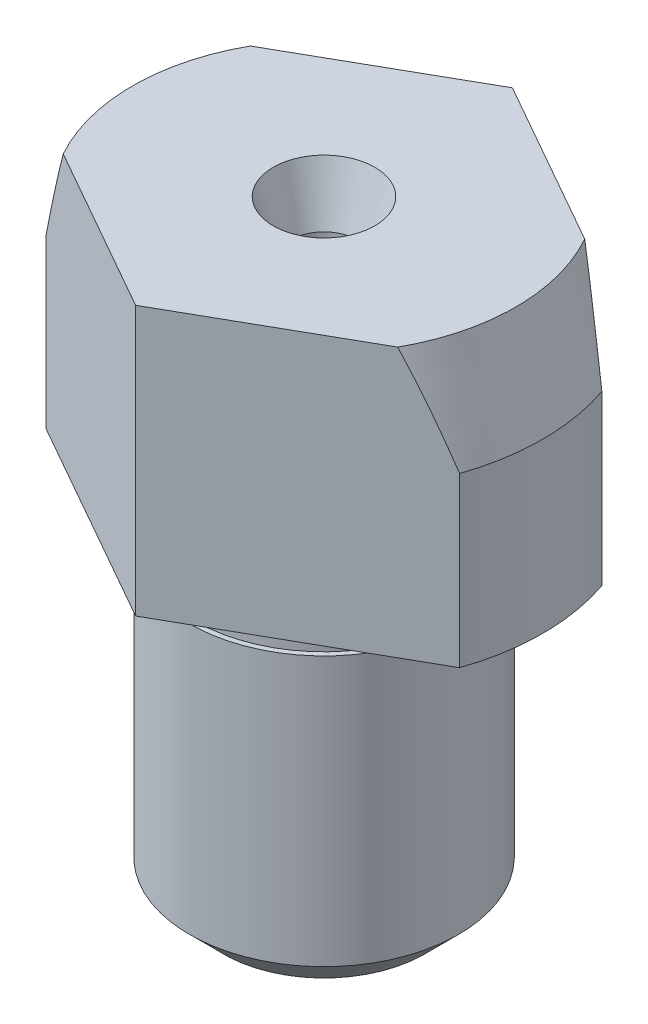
ISO-10303-21;
HEADER;
FILE_DESCRIPTION(('STEP AP214'),'2;1');
FILE_NAME('part.step','',(''),(''),'','','');
FILE_SCHEMA(('AUTOMOTIVE_DESIGN { 1 0 10303 214 1 1 1 1 }'));
ENDSEC;
DATA;
#1=APPLICATION_CONTEXT('core data for automotive mechanical design processes');
#2=APPLICATION_PROTOCOL_DEFINITION('international standard','automotive_design',2000,#1);
#3=PRODUCT_CONTEXT('',#1,'mechanical');
#4=PRODUCT('Part','Part','',(#3));
#5=PRODUCT_RELATED_PRODUCT_CATEGORY('part','',(#4));
#6=PRODUCT_DEFINITION_FORMATION('','',#4);
#7=PRODUCT_DEFINITION_CONTEXT('part definition',#1,'design');
#8=PRODUCT_DEFINITION('design','',#6,#7);
#9=PRODUCT_DEFINITION_SHAPE('','',#8);
#10=(LENGTH_UNIT() NAMED_UNIT(*) SI_UNIT(.MILLI.,.METRE.));
#11=(NAMED_UNIT(*) PLANE_ANGLE_UNIT() SI_UNIT($,.RADIAN.));
#12=(NAMED_UNIT(*) SI_UNIT($,.STERADIAN.) SOLID_ANGLE_UNIT());
#13=UNCERTAINTY_MEASURE_WITH_UNIT(LENGTH_MEASURE(1.E-05),#10,'distance_accuracy_value','');
#14=(GEOMETRIC_REPRESENTATION_CONTEXT(3) GLOBAL_UNCERTAINTY_ASSIGNED_CONTEXT((#13)) GLOBAL_UNIT_ASSIGNED_CONTEXT((#10,
#11,#12)) REPRESENTATION_CONTEXT('',''));
#15=CARTESIAN_POINT('',(0.,0.,0.));
#16=DIRECTION('',(0.,0.,1.));
#17=DIRECTION('',(1.,0.,0.));
#18=AXIS2_PLACEMENT_3D('',#15,#16,#17);
#19=CARTESIAN_POINT('',(0.,8.,-1.51));
#20=DIRECTION('',(0.,1.,0.));
#21=DIRECTION('',(0.,0.,1.));
#22=AXIS2_PLACEMENT_3D('',#19,#20,#21);
#23=PLANE('',#22);
#24=CARTESIAN_POINT('',(0.,8.,0.));
#25=DIRECTION('',(0.,-1.,0.));
#26=DIRECTION('',(0.,0.,-1.));
#27=AXIS2_PLACEMENT_3D('',#24,#25,#26);
#28=CIRCLE('',#27,1.51);
#29=CARTESIAN_POINT('',(0.,8.,-1.51));
#30=VERTEX_POINT('',#29);
#31=EDGE_CURVE('E203',#30,#30,#28,.T.);
#32=ORIENTED_EDGE('',*,*,#31,.T.);
#33=EDGE_LOOP('',(#32));
#34=FACE_BOUND('',#33,.T.);
#35=DIRECTION('',(-0.869833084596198,0.,-0.493346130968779));
#36=VECTOR('',#35,1.);
#37=CARTESIAN_POINT('',(9.87352482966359,8.,0.));
#38=LINE('',#37,#36);
#39=CARTESIAN_POINT('',(4.97154190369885,8.,-2.78027400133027));
#40=VERTEX_POINT('',#39);
#41=CARTESIAN_POINT('',(0.,8.,-5.6));
#42=VERTEX_POINT('',#41);
#43=EDGE_CURVE('E105',#40,#42,#38,.T.);
#44=ORIENTED_EDGE('',*,*,#43,.T.);
#45=DIRECTION('',(-0.869833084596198,0.,0.493346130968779));
#46=VECTOR('',#45,1.);
#47=CARTESIAN_POINT('',(0.,8.,-5.6));
#48=LINE('',#47,#46);
#49=CARTESIAN_POINT('',(-4.97154190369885,8.,-2.78027400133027));
#50=VERTEX_POINT('',#49);
#51=EDGE_CURVE('E111',#42,#50,#48,.T.);
#52=ORIENTED_EDGE('',*,*,#51,.T.);
#53=CARTESIAN_POINT('',(0.,8.,0.));
#54=DIRECTION('',(0.,-1.,0.));
#55=DIRECTION('',(0.,0.,-1.));
#56=AXIS2_PLACEMENT_3D('',#53,#54,#55);
#57=CIRCLE('',#56,5.69615242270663);
#58=CARTESIAN_POINT('',(-4.97154190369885,8.,2.78027400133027));
#59=VERTEX_POINT('',#58);
#60=EDGE_CURVE('E201',#59,#50,#57,.T.);
#61=ORIENTED_EDGE('',*,*,#60,.F.);
#62=DIRECTION('',(0.869833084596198,0.,0.493346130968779));
#63=VECTOR('',#62,1.);
#64=CARTESIAN_POINT('',(-9.87352482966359,8.,0.));
#65=LINE('',#64,#63);
#66=CARTESIAN_POINT('',(0.,8.,5.6));
#67=VERTEX_POINT('',#66);
#68=EDGE_CURVE('E125',#59,#67,#65,.T.);
#69=ORIENTED_EDGE('',*,*,#68,.T.);
#70=DIRECTION('',(0.869833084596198,0.,-0.493346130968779));
#71=VECTOR('',#70,1.);
#72=CARTESIAN_POINT('',(0.,8.,5.6));
#73=LINE('',#72,#71);
#74=CARTESIAN_POINT('',(4.97154190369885,8.,2.78027400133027));
#75=VERTEX_POINT('',#74);
#76=EDGE_CURVE('E123',#67,#75,#73,.T.);
#77=ORIENTED_EDGE('',*,*,#76,.T.);
#78=EDGE_CURVE('E122',#40,#75,#57,.T.);
#79=ORIENTED_EDGE('',*,*,#78,.F.);
#80=EDGE_LOOP('',(#44,#52,#61,#69,#77,#79));
#81=FACE_BOUND('',#80,.T.);
#82=ADVANCED_FACE('F32',(#34,#81),#23,.T.);
#83=CARTESIAN_POINT('',(0.,5.,0.));
#84=DIRECTION('',(0.,-1.,0.));
#85=DIRECTION('',(0.,0.,-1.));
#86=AXIS2_PLACEMENT_3D('',#83,#84,#85);
#87=CONICAL_SURFACE('',#86,6.5,0.26179938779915);
#88=CARTESIAN_POINT('',(0.,5.,0.));
#89=DIRECTION('',(0.,-1.,0.));
#90=DIRECTION('',(0.,0.,-1.));
#91=AXIS2_PLACEMENT_3D('',#88,#89,#90);
#92=CIRCLE('',#91,6.5);
#93=CARTESIAN_POINT('',(-6.14671173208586,5.,2.11374901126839));
#94=VERTEX_POINT('',#93);
#95=CARTESIAN_POINT('',(-6.14671173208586,5.,-2.11374901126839));
#96=VERTEX_POINT('',#95);
#97=EDGE_CURVE('E197',#94,#96,#92,.T.);
#98=ORIENTED_EDGE('',*,*,#97,.F.);
#99=CARTESIAN_POINT('',(-7.88064159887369,-0.453602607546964,1.1303102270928));
#100=CARTESIAN_POINT('',(-7.81543947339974,-0.232330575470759,1.16729113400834));
#101=CARTESIAN_POINT('',(-7.74984990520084,-0.0112095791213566,1.20449178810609));
#102=CARTESIAN_POINT('',(-7.6178014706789,0.430691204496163,1.27938613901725));
#103=CARTESIAN_POINT('',(-7.55134259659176,0.651470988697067,1.31707984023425));
#104=CARTESIAN_POINT('',(-7.35049361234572,1.3133279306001,1.43099602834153));
#105=CARTESIAN_POINT('',(-7.21465885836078,1.75382830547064,1.50803787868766));
#106=CARTESIAN_POINT('',(-6.93723870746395,2.63563888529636,1.66538319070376));
#107=CARTESIAN_POINT('',(-6.7956219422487,3.07693607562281,1.74570444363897));
#108=CARTESIAN_POINT('',(-6.50600923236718,3.95672114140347,1.90996504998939));
#109=CARTESIAN_POINT('',(-6.35801396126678,4.395209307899,1.99390402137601));
#110=CARTESIAN_POINT('',(-6.10140257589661,5.13056451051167,2.13944715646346));
#111=CARTESIAN_POINT('',(-5.99508438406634,5.42848939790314,2.19974799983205));
#112=CARTESIAN_POINT('',(-5.77729576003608,6.02189899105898,2.32327189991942));
#113=CARTESIAN_POINT('',(-5.6658246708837,6.31738337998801,2.38649532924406));
#114=CARTESIAN_POINT('',(-5.43649671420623,6.90418177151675,2.51656403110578));
#115=CARTESIAN_POINT('',(-5.31865659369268,7.19550438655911,2.58339980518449));
#116=CARTESIAN_POINT('',(-5.07408105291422,7.77314440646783,2.72211653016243));
#117=CARTESIAN_POINT('',(-4.94734823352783,8.05946324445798,2.79399600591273));
#118=CARTESIAN_POINT('',(-4.72369530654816,8.53401587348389,2.92084598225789));
#119=CARTESIAN_POINT('',(-4.63018399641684,8.7243652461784,2.97388310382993));
#120=CARTESIAN_POINT('',(-4.43515280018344,9.10021820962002,3.0844995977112));
#121=CARTESIAN_POINT('',(-4.33361611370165,9.28571049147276,3.14208849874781));
#122=CARTESIAN_POINT('',(-4.16929516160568,9.56439057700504,3.23528696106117));
#123=CARTESIAN_POINT('',(-4.11033442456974,9.6605521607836,3.26872791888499));
#124=CARTESIAN_POINT('',(-3.98864809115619,9.84965946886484,3.33774516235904));
#125=CARTESIAN_POINT('',(-3.92592355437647,9.94260608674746,3.37332084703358));
#126=CARTESIAN_POINT('',(-3.79603824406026,10.123911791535,3.44698833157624));
#127=CARTESIAN_POINT('',(-3.72889034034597,10.2122829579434,3.48507283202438));
#128=CARTESIAN_POINT('',(-3.58897587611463,10.3828779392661,3.56442858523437));
#129=CARTESIAN_POINT('',(-3.51621499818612,10.4651078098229,3.60569661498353));
#130=CARTESIAN_POINT('',(-3.37491478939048,10.6092068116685,3.68583832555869));
#131=CARTESIAN_POINT('',(-3.30732679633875,10.6722921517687,3.72417243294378));
#132=CARTESIAN_POINT('',(-3.16613498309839,10.7892397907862,3.80425266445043));
#133=CARTESIAN_POINT('',(-3.09252547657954,10.8430932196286,3.84600201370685));
#134=CARTESIAN_POINT('',(-2.93763282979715,10.9381755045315,3.93385299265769));
#135=CARTESIAN_POINT('',(-2.85624506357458,10.9791867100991,3.98001396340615));
#136=CARTESIAN_POINT('',(-2.68806363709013,11.041702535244,4.07540198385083));
#137=CARTESIAN_POINT('',(-2.60129302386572,11.0632849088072,4.12461596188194));
#138=CARTESIAN_POINT('',(-2.43743302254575,11.081603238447,4.21755298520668));
#139=CARTESIAN_POINT('',(-2.36059558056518,11.0812686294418,4.26113313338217));
#140=CARTESIAN_POINT('',(-2.20846413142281,11.0630269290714,4.34741803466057));
#141=CARTESIAN_POINT('',(-2.13317269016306,11.0450927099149,4.39012133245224));
#142=CARTESIAN_POINT('',(-1.97660283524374,10.9908765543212,4.4789235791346));
#143=CARTESIAN_POINT('',(-1.89591225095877,10.9524222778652,4.52468912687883));
#144=CARTESIAN_POINT('',(-1.74082069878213,10.861487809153,4.61265291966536));
#145=CARTESIAN_POINT('',(-1.66643120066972,10.8089827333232,4.65484465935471));
#146=CARTESIAN_POINT('',(-1.52959497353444,10.6989931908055,4.73245451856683));
#147=CARTESIAN_POINT('',(-1.46666929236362,10.6422774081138,4.76814428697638));
#148=CARTESIAN_POINT('',(-1.3452049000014,10.5228898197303,4.83703565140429));
#149=CARTESIAN_POINT('',(-1.28667035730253,10.4602124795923,4.87023488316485));
#150=CARTESIAN_POINT('',(-1.17320759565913,10.3303150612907,4.93458793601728));
#151=CARTESIAN_POINT('',(-1.11829177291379,10.2630808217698,4.96573472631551));
#152=CARTESIAN_POINT('',(-1.01171709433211,10.1253663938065,5.02618104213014));
#153=CARTESIAN_POINT('',(-0.960056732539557,10.0548877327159,5.05548142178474));
#154=CARTESIAN_POINT('',(-0.816819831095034,9.85062543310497,5.13672157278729));
#155=CARTESIAN_POINT('',(-0.72851906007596,9.71381180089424,5.18680341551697));
#156=CARTESIAN_POINT('',(-0.558838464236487,9.43458645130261,5.28304172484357));
#157=CARTESIAN_POINT('',(-0.477463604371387,9.29217082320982,5.32919537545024));
#158=CARTESIAN_POINT('',(-0.319940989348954,9.0031569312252,5.41853800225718));
#159=CARTESIAN_POINT('',(-0.243805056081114,8.85655020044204,5.46172027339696));
#160=CARTESIAN_POINT('',(-0.0958265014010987,8.56049606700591,5.54564976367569));
#161=CARTESIAN_POINT('',(-0.0239844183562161,8.41104831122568,5.58639667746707));
#162=CARTESIAN_POINT('',(0.116751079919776,8.10885511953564,5.66621809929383));
#163=CARTESIAN_POINT('',(0.185617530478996,7.95609315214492,5.70527731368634));
#164=CARTESIAN_POINT('',(0.320425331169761,7.64886836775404,5.78173670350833));
#165=CARTESIAN_POINT('',(0.386366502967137,7.49440544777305,5.81913677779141));
#166=CARTESIAN_POINT('',(0.580343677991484,7.02945904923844,5.929155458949));
#167=CARTESIAN_POINT('',(0.704738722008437,6.71696802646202,5.99970901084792));
#168=CARTESIAN_POINT('',(0.934778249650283,6.11870068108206,6.13018129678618));
#169=CARTESIAN_POINT('',(1.04107450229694,5.83325166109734,6.19046969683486));
#170=CARTESIAN_POINT('',(1.24911859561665,5.26015876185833,6.30846675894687));
#171=CARTESIAN_POINT('',(1.35086621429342,4.97251477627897,6.36617529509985));
#172=CARTESIAN_POINT('',(1.55078683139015,4.39534153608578,6.47956493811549));
#173=CARTESIAN_POINT('',(1.64895704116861,4.10581100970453,6.53524446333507));
#174=CARTESIAN_POINT('',(1.84230268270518,3.52543046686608,6.64490495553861));
#175=CARTESIAN_POINT('',(1.93747808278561,3.23458043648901,6.69888590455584));
#176=CARTESIAN_POINT('',(2.12220167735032,2.66153520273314,6.80365620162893));
#177=CARTESIAN_POINT('',(2.21183168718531,2.37937478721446,6.85449195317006));
#178=CARTESIAN_POINT('',(2.38911133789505,1.81423100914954,6.95504024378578));
#179=CARTESIAN_POINT('',(2.47676096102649,1.53124763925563,7.00475277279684));
#180=CARTESIAN_POINT('',(2.65025220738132,0.964949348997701,7.1031523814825));
#181=CARTESIAN_POINT('',(2.73609596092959,0.681635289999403,7.15184066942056));
#182=CARTESIAN_POINT('',(2.90630309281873,0.114427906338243,7.24837761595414));
#183=CARTESIAN_POINT('',(2.99066650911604,-0.169465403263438,7.29622629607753));
#184=CARTESIAN_POINT('',(3.07439918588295,-0.453602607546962,7.34371723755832));
#185=B_SPLINE_CURVE_WITH_KNOTS('',3,(#99,#100,#101,#102,#103,#104,#105,#106,#107,#108,#109,#110,
#111,#112,#113,#114,#115,#116,#117,#118,#119,#120,#121,#122,#123,#124,#125,#126,#127,#128,#129,
#130,#131,#132,#133,#134,#135,#136,#137,#138,#139,#140,#141,#142,#143,#144,#145,#146,#147,#148,
#149,#150,#151,#152,#153,#154,#155,#156,#157,#158,#159,#160,#161,#162,#163,#164,#165,#166,#167,
#168,#169,#170,#171,#172,#173,#174,#175,#176,#177,#178,#179,#180,#181,#182,#183,#184),
.UNSPECIFIED.,.F.,.F.,(4,2,2,2,2,2,2,2,2,2,2,2,2,2,2,2,2,2,2,2,2,2,2,2,2,2,2,2,2,2,2,2,2,2,2,2,
2,2,2,2,2,2,4),(0.,0.700871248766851,1.40174876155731,2.80380259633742,4.21487434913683,
5.62579745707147,6.59182106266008,7.55796816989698,8.52168796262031,9.48512705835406,
10.1408030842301,10.7978900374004,11.1507507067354,11.5035124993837,11.8552897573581,
12.2067154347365,12.5064894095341,12.8065498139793,13.1114502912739,13.4151250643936,
13.6783056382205,13.9418925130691,14.241498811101,14.5416392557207,14.8170066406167,
15.0926322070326,15.3691575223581,15.6455539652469,16.1561926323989,16.6671943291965,
17.1793136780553,17.6914971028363,18.2076243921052,18.7237831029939,19.7545772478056,
20.6860448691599,21.6175579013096,22.5497821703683,23.4820162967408,24.3831659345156,
25.2843236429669,26.1843507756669,27.0843547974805),.UNSPECIFIED.);
#186=EDGE_CURVE('E160',#94,#59,#185,.T.);
#187=ORIENTED_EDGE('',*,*,#186,.T.);
#188=ORIENTED_EDGE('',*,*,#60,.T.);
#189=CARTESIAN_POINT('',(3.07439918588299,-0.453602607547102,-7.34371723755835));
#190=CARTESIAN_POINT('',(3.00919706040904,-0.23233057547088,-7.3067363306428));
#191=CARTESIAN_POINT('',(2.94360749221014,-0.0112095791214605,-7.26953567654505));
#192=CARTESIAN_POINT('',(2.81155905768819,0.430691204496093,-7.19464132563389));
#193=CARTESIAN_POINT('',(2.74510018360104,0.651470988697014,-7.15694762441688));
#194=CARTESIAN_POINT('',(2.54425119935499,1.3133279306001,-7.0430314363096));
#195=CARTESIAN_POINT('',(2.40841644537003,1.75382830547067,-6.96598958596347));
#196=CARTESIAN_POINT('',(2.13099629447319,2.63563888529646,-6.80864427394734));
#197=CARTESIAN_POINT('',(1.98937952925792,3.07693607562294,-6.72832302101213));
#198=CARTESIAN_POINT('',(1.69976681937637,3.95672114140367,-6.5640624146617));
#199=CARTESIAN_POINT('',(1.55177154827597,4.39520930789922,-6.48012344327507));
#200=CARTESIAN_POINT('',(1.29516016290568,5.13056451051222,-6.33458030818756));
#201=CARTESIAN_POINT('',(1.18884197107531,5.42848939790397,-6.2742794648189));
#202=CARTESIAN_POINT('',(0.971053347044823,6.02189899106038,-6.15075556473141));
#203=CARTESIAN_POINT('',(0.859582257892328,6.31738337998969,-6.08753213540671));
#204=CARTESIAN_POINT('',(0.6302543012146,6.90418177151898,-5.95746343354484));
#205=CARTESIAN_POINT('',(0.512414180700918,7.19550438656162,-5.89062765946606));
#206=CARTESIAN_POINT('',(0.267838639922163,7.77314440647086,-5.75191093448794));
#207=CARTESIAN_POINT('',(0.141105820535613,8.05946324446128,-5.68003145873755));
#208=CARTESIAN_POINT('',(-0.0825471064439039,8.5340158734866,-5.55318148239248));
#209=CARTESIAN_POINT('',(-0.176058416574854,8.72436524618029,-5.50014436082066));
#210=CARTESIAN_POINT('',(-0.371089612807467,9.10021820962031,-5.38952786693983));
#211=CARTESIAN_POINT('',(-0.472626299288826,9.28571049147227,-5.33193896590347));
#212=CARTESIAN_POINT('',(-0.636947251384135,9.56439057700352,-5.23874050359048));
#213=CARTESIAN_POINT('',(-0.695907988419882,9.6605521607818,-5.20529954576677));
#214=CARTESIAN_POINT('',(-0.817594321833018,9.84965946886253,-5.13628230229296));
#215=CARTESIAN_POINT('',(-0.880318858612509,9.9426060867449,-5.10070661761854));
#216=CARTESIAN_POINT('',(-1.01020416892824,10.123911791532,-5.02703913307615));
#217=CARTESIAN_POINT('',(-1.07735207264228,10.2122829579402,-4.98895463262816));
#218=CARTESIAN_POINT('',(-1.21726653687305,10.3828779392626,-4.90959887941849));
#219=CARTESIAN_POINT('',(-1.29002741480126,10.4651078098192,-4.8683308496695));
#220=CARTESIAN_POINT('',(-1.43132762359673,10.6092068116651,-4.78818913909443));
#221=CARTESIAN_POINT('',(-1.49891561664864,10.6722921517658,-4.74985503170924));
#222=CARTESIAN_POINT('',(-1.64010742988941,10.789239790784,-4.66977480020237));
#223=CARTESIAN_POINT('',(-1.71371693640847,10.8430932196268,-4.62802545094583));
#224=CARTESIAN_POINT('',(-1.86860958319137,10.9381755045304,-4.5401744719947));
#225=CARTESIAN_POINT('',(-1.94999734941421,10.9791867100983,-4.49401350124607));
#226=CARTESIAN_POINT('',(-2.11817877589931,11.0417025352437,-4.39862548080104));
#227=CARTESIAN_POINT('',(-2.20494938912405,11.063284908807,-4.34941150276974));
#228=CARTESIAN_POINT('',(-2.36880939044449,11.081603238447,-4.25647447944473));
#229=CARTESIAN_POINT('',(-2.44564683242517,11.0812686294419,-4.21289433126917));
#230=CARTESIAN_POINT('',(-2.59777828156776,11.0630269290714,-4.12660942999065));
#231=CARTESIAN_POINT('',(-2.67306972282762,11.045092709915,-4.08390613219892));
#232=CARTESIAN_POINT('',(-2.82963957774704,10.9908765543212,-3.9951038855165));
#233=CARTESIAN_POINT('',(-2.91033016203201,10.9524222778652,-3.94933833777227));
#234=CARTESIAN_POINT('',(-3.06542171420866,10.861487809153,-3.86137454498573));
#235=CARTESIAN_POINT('',(-3.13981121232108,10.8089827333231,-3.81918280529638));
#236=CARTESIAN_POINT('',(-3.27664743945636,10.6989931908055,-3.74157294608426));
#237=CARTESIAN_POINT('',(-3.33957312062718,10.6422774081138,-3.70588317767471));
#238=CARTESIAN_POINT('',(-3.46103751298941,10.5228898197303,-3.63699181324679));
#239=CARTESIAN_POINT('',(-3.51957205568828,10.4602124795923,-3.60379258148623));
#240=CARTESIAN_POINT('',(-3.63303481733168,10.3303150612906,-3.53943952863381));
#241=CARTESIAN_POINT('',(-3.68795064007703,10.2630808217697,-3.50829273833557));
#242=CARTESIAN_POINT('',(-3.79452531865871,10.1253663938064,-3.44784642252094));
#243=CARTESIAN_POINT('',(-3.84618568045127,10.0548877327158,-3.41854604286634));
#244=CARTESIAN_POINT('',(-3.9894225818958,9.85062543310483,-3.33730589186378));
#245=CARTESIAN_POINT('',(-4.07772335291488,9.71381180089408,-3.28722404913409));
#246=CARTESIAN_POINT('',(-4.24740394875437,9.4345864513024,-3.19098573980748));
#247=CARTESIAN_POINT('',(-4.32877880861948,9.2921708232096,-3.14483208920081));
#248=CARTESIAN_POINT('',(-4.48630142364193,9.00315693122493,-3.05548946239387));
#249=CARTESIAN_POINT('',(-4.56243735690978,8.85655020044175,-3.01230719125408));
#250=CARTESIAN_POINT('',(-4.71041591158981,8.56049606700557,-2.92837770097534));
#251=CARTESIAN_POINT('',(-4.7822579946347,8.41104831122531,-2.88763078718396));
#252=CARTESIAN_POINT('',(-4.9229934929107,8.10885511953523,-2.80780936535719));
#253=CARTESIAN_POINT('',(-4.99185994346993,7.95609315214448,-2.76875015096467));
#254=CARTESIAN_POINT('',(-5.12666774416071,7.64886836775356,-2.69229076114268));
#255=CARTESIAN_POINT('',(-5.19260891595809,7.49440544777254,-2.65489068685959));
#256=CARTESIAN_POINT('',(-5.38658609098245,7.02945904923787,-2.54487200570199));
#257=CARTESIAN_POINT('',(-5.51098113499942,6.7169680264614,-2.47431845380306));
#258=CARTESIAN_POINT('',(-5.74102066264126,6.11870068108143,-2.34384616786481));
#259=CARTESIAN_POINT('',(-5.84731691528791,5.83325166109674,-2.28355776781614));
#260=CARTESIAN_POINT('',(-6.05536100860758,5.26015876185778,-2.16556070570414));
#261=CARTESIAN_POINT('',(-6.15710862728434,4.97251477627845,-2.10785216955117));
#262=CARTESIAN_POINT('',(-6.35702924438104,4.39534153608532,-1.99446252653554));
#263=CARTESIAN_POINT('',(-6.45519945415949,4.1058110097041,-1.93878300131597));
#264=CARTESIAN_POINT('',(-6.64854509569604,3.52543046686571,-1.82912250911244));
#265=CARTESIAN_POINT('',(-6.74372049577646,3.23458043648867,-1.77514156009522));
#266=CARTESIAN_POINT('',(-6.92844409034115,2.66153520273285,-1.67037126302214));
#267=CARTESIAN_POINT('',(-7.01807410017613,2.3793747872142,-1.61953551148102));
#268=CARTESIAN_POINT('',(-7.19535375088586,1.81423100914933,-1.51898722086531));
#269=CARTESIAN_POINT('',(-7.28300337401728,1.53124763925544,-1.46927469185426));
#270=CARTESIAN_POINT('',(-7.4564946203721,0.964949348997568,-1.37087508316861));
#271=CARTESIAN_POINT('',(-7.54233837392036,0.681635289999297,-1.32218679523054));
#272=CARTESIAN_POINT('',(-7.71254550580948,0.114427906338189,-1.22564984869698));
#273=CARTESIAN_POINT('',(-7.79690892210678,-0.169465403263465,-1.17780116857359));
#274=CARTESIAN_POINT('',(-7.88064159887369,-0.453602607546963,-1.1303102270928));
#275=B_SPLINE_CURVE_WITH_KNOTS('',3,(#189,#190,#191,#192,#193,#194,#195,#196,#197,#198,#199,
#200,#201,#202,#203,#204,#205,#206,#207,#208,#209,#210,#211,#212,#213,#214,#215,#216,#217,#218,
#219,#220,#221,#222,#223,#224,#225,#226,#227,#228,#229,#230,#231,#232,#233,#234,#235,#236,#237,
#238,#239,#240,#241,#242,#243,#244,#245,#246,#247,#248,#249,#250,#251,#252,#253,#254,#255,#256,
#257,#258,#259,#260,#261,#262,#263,#264,#265,#266,#267,#268,#269,#270,#271,#272,#273,#274),
.UNSPECIFIED.,.F.,.F.,(4,2,2,2,2,2,2,2,2,2,2,2,2,2,2,2,2,2,2,2,2,2,2,2,2,2,2,2,2,2,2,2,2,2,2,2,
2,2,2,2,2,2,4),(0.,0.700871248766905,1.40174876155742,2.80380259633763,4.21487434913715,
5.6257974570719,6.59182106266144,7.55796816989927,8.52168796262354,9.48512705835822,
10.1408030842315,10.7978900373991,11.1507507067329,11.5035124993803,11.8552897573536,
12.2067154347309,12.5064894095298,12.8065498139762,13.1114502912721,13.415125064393,
13.6783056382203,13.9418925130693,14.2414988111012,14.541639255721,14.8170066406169,
15.0926322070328,15.3691575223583,15.6455539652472,16.1561926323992,16.6671943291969,
17.1793136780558,17.6914971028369,18.2076243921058,18.7237831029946,19.7545772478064,
20.6860448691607,21.6175579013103,22.5497821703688,23.4820162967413,24.383165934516,
25.2843236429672,26.1843507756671,27.0843547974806),.UNSPECIFIED.);
#276=EDGE_CURVE('E114',#50,#96,#275,.T.);
#277=ORIENTED_EDGE('',*,*,#276,.T.);
#278=EDGE_LOOP('',(#98,#187,#188,#277));
#279=FACE_BOUND('',#278,.T.);
#280=ADVANCED_FACE('F141',(#279),#87,.T.);
#281=CARTESIAN_POINT('',(6.14671173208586,5.,-2.11374901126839));
#282=VERTEX_POINT('',#281);
#283=CARTESIAN_POINT('',(6.14671173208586,5.,2.11374901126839));
#284=VERTEX_POINT('',#283);
#285=EDGE_CURVE('E198',#282,#284,#92,.T.);
#286=ORIENTED_EDGE('',*,*,#285,.F.);
#287=CARTESIAN_POINT('',(7.88064159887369,-0.45360260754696,-1.1303102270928));
#288=CARTESIAN_POINT('',(7.81543947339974,-0.232330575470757,-1.16729113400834));
#289=CARTESIAN_POINT('',(7.74984990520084,-0.0112095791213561,-1.20449178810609));
#290=CARTESIAN_POINT('',(7.6178014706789,0.430691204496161,-1.27938613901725));
#291=CARTESIAN_POINT('',(7.55134259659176,0.651470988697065,-1.31707984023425));
#292=CARTESIAN_POINT('',(7.35049361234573,1.31332793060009,-1.43099602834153));
#293=CARTESIAN_POINT('',(7.21465885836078,1.75382830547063,-1.50803787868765));
#294=CARTESIAN_POINT('',(6.93723870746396,2.63563888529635,-1.66538319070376));
#295=CARTESIAN_POINT('',(6.7956219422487,3.07693607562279,-1.74570444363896));
#296=CARTESIAN_POINT('',(6.50600923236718,3.95672114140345,-1.90996504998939));
#297=CARTESIAN_POINT('',(6.35801396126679,4.39520930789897,-1.99390402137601));
#298=CARTESIAN_POINT('',(6.10140257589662,5.13056451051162,-2.13944715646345));
#299=CARTESIAN_POINT('',(5.99508438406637,5.42848939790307,-2.19974799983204));
#300=CARTESIAN_POINT('',(5.77729576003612,6.02189899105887,-2.32327189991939));
#301=CARTESIAN_POINT('',(5.66582467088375,6.31738337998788,-2.38649532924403));
#302=CARTESIAN_POINT('',(5.4364967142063,6.90418177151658,-2.51656403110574));
#303=CARTESIAN_POINT('',(5.31865659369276,7.19550438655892,-2.58339980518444));
#304=CARTESIAN_POINT('',(5.07408105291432,7.77314440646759,-2.72211653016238));
#305=CARTESIAN_POINT('',(4.94734823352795,8.05946324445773,-2.79399600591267));
#306=CARTESIAN_POINT('',(4.72369530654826,8.53401587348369,-2.92084598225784));
#307=CARTESIAN_POINT('',(4.63018399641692,8.72436524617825,-2.97388310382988));
#308=CARTESIAN_POINT('',(4.43515280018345,9.10021820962,-3.08449959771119));
#309=CARTESIAN_POINT('',(4.33361611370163,9.2857104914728,-3.14208849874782));
#310=CARTESIAN_POINT('',(4.16929516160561,9.56439057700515,-3.23528696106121));
#311=CARTESIAN_POINT('',(4.11033442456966,9.66055216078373,-3.26872791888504));
#312=CARTESIAN_POINT('',(3.98864809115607,9.84965946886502,-3.3377451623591));
#313=CARTESIAN_POINT('',(3.92592355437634,9.94260608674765,-3.37332084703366));
#314=CARTESIAN_POINT('',(3.79603824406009,10.1239117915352,-3.44698833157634));
#315=CARTESIAN_POINT('',(3.72889034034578,10.2122829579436,-3.48507283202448));
#316=CARTESIAN_POINT('',(3.58897587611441,10.3828779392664,-3.5644285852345));
#317=CARTESIAN_POINT('',(3.51621499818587,10.4651078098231,-3.60569661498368));
#318=CARTESIAN_POINT('',(3.37491478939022,10.6092068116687,-3.68583832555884));
#319=CARTESIAN_POINT('',(3.3073267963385,10.672292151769,-3.72417243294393));
#320=CARTESIAN_POINT('',(3.16613498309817,10.7892397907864,-3.80425266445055));
#321=CARTESIAN_POINT('',(3.09252547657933,10.8430932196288,-3.84600201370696));
#322=CARTESIAN_POINT('',(2.93763282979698,10.9381755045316,-3.93385299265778));
#323=CARTESIAN_POINT('',(2.85624506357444,10.9791867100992,-3.98001396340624));
#324=CARTESIAN_POINT('',(2.68806363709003,11.041702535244,-4.07540198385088));
#325=CARTESIAN_POINT('',(2.60129302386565,11.0632849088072,-4.12461596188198));
#326=CARTESIAN_POINT('',(2.43743302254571,11.081603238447,-4.2175529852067));
#327=CARTESIAN_POINT('',(2.36059558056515,11.0812686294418,-4.26113313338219));
#328=CARTESIAN_POINT('',(2.2084641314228,11.0630269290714,-4.34741803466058));
#329=CARTESIAN_POINT('',(2.13317269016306,11.0450927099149,-4.39012133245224));
#330=CARTESIAN_POINT('',(1.97660283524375,10.9908765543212,-4.4789235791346));
#331=CARTESIAN_POINT('',(1.89591225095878,10.9524222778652,-4.52468912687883));
#332=CARTESIAN_POINT('',(1.74082069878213,10.861487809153,-4.61265291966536));
#333=CARTESIAN_POINT('',(1.66643120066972,10.8089827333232,-4.65484465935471));
#334=CARTESIAN_POINT('',(1.52959497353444,10.6989931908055,-4.73245451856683));
#335=CARTESIAN_POINT('',(1.46666929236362,10.6422774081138,-4.76814428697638));
#336=CARTESIAN_POINT('',(1.34520490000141,10.5228898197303,-4.83703565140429));
#337=CARTESIAN_POINT('',(1.28667035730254,10.4602124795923,-4.87023488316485));
#338=CARTESIAN_POINT('',(1.17320759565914,10.3303150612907,-4.93458793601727));
#339=CARTESIAN_POINT('',(1.11829177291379,10.2630808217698,-4.96573472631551));
#340=CARTESIAN_POINT('',(1.01171709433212,10.1253663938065,-5.02618104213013));
#341=CARTESIAN_POINT('',(0.960056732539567,10.0548877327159,-5.05548142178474));
#342=CARTESIAN_POINT('',(0.816819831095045,9.85062543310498,-5.13672157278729));
#343=CARTESIAN_POINT('',(0.728519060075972,9.71381180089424,-5.18680341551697));
#344=CARTESIAN_POINT('',(0.5588384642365,9.43458645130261,-5.28304172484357));
#345=CARTESIAN_POINT('',(0.4774636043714,9.29217082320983,-5.32919537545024));
#346=CARTESIAN_POINT('',(0.319940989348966,9.00315693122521,-5.41853800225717));
#347=CARTESIAN_POINT('',(0.243805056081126,8.85655020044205,-5.46172027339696));
#348=CARTESIAN_POINT('',(0.0958265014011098,8.56049606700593,-5.54564976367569));
#349=CARTESIAN_POINT('',(0.0239844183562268,8.41104831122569,-5.58639667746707));
#350=CARTESIAN_POINT('',(-0.116751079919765,8.10885511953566,-5.66621809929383));
#351=CARTESIAN_POINT('',(-0.185617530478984,7.95609315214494,-5.70527731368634));
#352=CARTESIAN_POINT('',(-0.320425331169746,7.64886836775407,-5.78173670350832));
#353=CARTESIAN_POINT('',(-0.386366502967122,7.49440544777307,-5.81913677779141));
#354=CARTESIAN_POINT('',(-0.580343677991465,7.02945904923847,-5.929155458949));
#355=CARTESIAN_POINT('',(-0.704738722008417,6.71696802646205,-5.99970901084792));
#356=CARTESIAN_POINT('',(-0.934778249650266,6.11870068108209,-6.13018129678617));
#357=CARTESIAN_POINT('',(-1.04107450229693,5.83325166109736,-6.19046969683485));
#358=CARTESIAN_POINT('',(-1.24911859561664,5.26015876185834,-6.30846675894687));
#359=CARTESIAN_POINT('',(-1.35086621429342,4.97251477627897,-6.36617529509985));
#360=CARTESIAN_POINT('',(-1.55078683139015,4.39534153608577,-6.4795649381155));
#361=CARTESIAN_POINT('',(-1.64895704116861,4.10581100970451,-6.53524446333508));
#362=CARTESIAN_POINT('',(-1.84230268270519,3.52543046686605,-6.64490495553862));
#363=CARTESIAN_POINT('',(-1.93747808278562,3.23458043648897,-6.69888590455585));
#364=CARTESIAN_POINT('',(-2.12220167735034,2.66153520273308,-6.80365620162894));
#365=CARTESIAN_POINT('',(-2.21183168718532,2.3793747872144,-6.85449195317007));
#366=CARTESIAN_POINT('',(-2.38911133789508,1.81423100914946,-6.9550402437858));
#367=CARTESIAN_POINT('',(-2.47676096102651,1.53124763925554,-7.00475277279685));
#368=CARTESIAN_POINT('',(-2.65025220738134,0.964949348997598,-7.10315238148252));
#369=CARTESIAN_POINT('',(-2.73609596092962,0.681635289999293,-7.15184066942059));
#370=CARTESIAN_POINT('',(-2.90630309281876,0.114427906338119,-7.24837761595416));
#371=CARTESIAN_POINT('',(-2.99066650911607,-0.169465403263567,-7.29622629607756));
#372=CARTESIAN_POINT('',(-3.07439918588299,-0.453602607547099,-7.34371723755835));
#373=B_SPLINE_CURVE_WITH_KNOTS('',3,(#287,#288,#289,#290,#291,#292,#293,#294,#295,#296,#297,
#298,#299,#300,#301,#302,#303,#304,#305,#306,#307,#308,#309,#310,#311,#312,#313,#314,#315,#316,
#317,#318,#319,#320,#321,#322,#323,#324,#325,#326,#327,#328,#329,#330,#331,#332,#333,#334,#335,
#336,#337,#338,#339,#340,#341,#342,#343,#344,#345,#346,#347,#348,#349,#350,#351,#352,#353,#354,
#355,#356,#357,#358,#359,#360,#361,#362,#363,#364,#365,#366,#367,#368,#369,#370,#371,#372),
.UNSPECIFIED.,.F.,.F.,(4,2,2,2,2,2,2,2,2,2,2,2,2,2,2,2,2,2,2,2,2,2,2,2,2,2,2,2,2,2,2,2,2,2,2,2,
2,2,2,2,2,2,4),(0.,0.700871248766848,1.4017487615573,2.8038025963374,4.2148743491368,
5.62579745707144,6.59182106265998,7.55796816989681,8.52168796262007,9.48512705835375,
10.14080308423,10.7978900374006,11.1507507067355,11.503512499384,11.8552897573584,
12.2067154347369,12.5064894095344,12.8065498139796,13.1114502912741,13.4151250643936,
13.6783056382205,13.9418925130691,14.241498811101,14.5416392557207,14.8170066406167,
15.0926322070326,15.369157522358,15.6455539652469,16.1561926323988,16.6671943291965,
17.1793136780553,17.6914971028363,18.2076243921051,18.7237831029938,19.7545772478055,
20.6860448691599,21.6175579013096,22.5497821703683,23.4820162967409,24.3831659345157,
25.284323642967,26.184350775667,27.0843547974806),.UNSPECIFIED.);
#374=EDGE_CURVE('E226',#282,#40,#373,.T.);
#375=ORIENTED_EDGE('',*,*,#374,.T.);
#376=ORIENTED_EDGE('',*,*,#78,.T.);
#377=CARTESIAN_POINT('',(-3.07439918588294,-0.45360260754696,7.34371723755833));
#378=CARTESIAN_POINT('',(-3.009197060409,-0.232330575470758,7.30673633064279));
#379=CARTESIAN_POINT('',(-2.9436074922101,-0.0112095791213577,7.26953567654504));
#380=CARTESIAN_POINT('',(-2.81155905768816,0.430691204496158,7.19464132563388));
#381=CARTESIAN_POINT('',(-2.74510018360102,0.65147098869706,7.15694762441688));
#382=CARTESIAN_POINT('',(-2.54425119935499,1.31332793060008,7.0430314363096));
#383=CARTESIAN_POINT('',(-2.40841644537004,1.75382830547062,6.96598958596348));
#384=CARTESIAN_POINT('',(-2.13099629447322,2.63563888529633,6.80864427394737));
#385=CARTESIAN_POINT('',(-1.98937952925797,3.07693607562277,6.72832302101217));
#386=CARTESIAN_POINT('',(-1.69976681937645,3.95672114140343,6.56406241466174));
#387=CARTESIAN_POINT('',(-1.55177154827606,4.39520930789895,6.48012344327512));
#388=CARTESIAN_POINT('',(-1.2951601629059,5.13056451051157,6.33458030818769));
#389=CARTESIAN_POINT('',(-1.18884197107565,5.428489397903,6.2742794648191));
#390=CARTESIAN_POINT('',(-0.971053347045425,6.02189899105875,6.15075556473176));
#391=CARTESIAN_POINT('',(-0.859582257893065,6.31738337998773,6.08753213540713));
#392=CARTESIAN_POINT('',(-0.630254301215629,6.90418177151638,5.95746343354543));
#393=CARTESIAN_POINT('',(-0.512414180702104,7.1955043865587,5.89062765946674));
#394=CARTESIAN_POINT('',(-0.267838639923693,7.77314440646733,5.75191093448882));
#395=CARTESIAN_POINT('',(-0.141105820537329,8.05946324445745,5.68003145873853));
#396=CARTESIAN_POINT('',(0.0825471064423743,8.53401587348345,5.55318148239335));
#397=CARTESIAN_POINT('',(0.176058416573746,8.72436524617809,5.50014436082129));
#398=CARTESIAN_POINT('',(0.371089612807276,9.10021820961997,5.38952786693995));
#399=CARTESIAN_POINT('',(0.472626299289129,9.28571049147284,5.3319389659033));
#400=CARTESIAN_POINT('',(0.636947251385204,9.56439057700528,5.23874050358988));
#401=CARTESIAN_POINT('',(0.695907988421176,9.66055216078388,5.20529954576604));
#402=CARTESIAN_POINT('',(0.817594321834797,9.8496594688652,5.13628230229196));
#403=CARTESIAN_POINT('',(0.880318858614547,9.94260608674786,5.10070661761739));
#404=CARTESIAN_POINT('',(1.01020416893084,10.1239117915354,5.02703913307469));
#405=CARTESIAN_POINT('',(1.07735207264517,10.2122829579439,4.98895463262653));
#406=CARTESIAN_POINT('',(1.21726653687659,10.3828779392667,4.90959887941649));
#407=CARTESIAN_POINT('',(1.29002741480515,10.4651078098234,4.8683308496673));
#408=CARTESIAN_POINT('',(1.43132762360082,10.609206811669,4.78818913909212));
#409=CARTESIAN_POINT('',(1.49891561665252,10.6722921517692,4.74985503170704));
#410=CARTESIAN_POINT('',(1.64010742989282,10.7892397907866,4.66977480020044));
#411=CARTESIAN_POINT('',(1.71371693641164,10.8430932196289,4.62802545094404));
#412=CARTESIAN_POINT('',(1.86860958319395,10.9381755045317,4.54017447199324));
#413=CARTESIAN_POINT('',(1.94999734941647,10.9791867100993,4.4940135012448));
#414=CARTESIAN_POINT('',(2.11817877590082,11.041702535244,4.39862548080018));
#415=CARTESIAN_POINT('',(2.20494938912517,11.0632849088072,4.3494115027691));
#416=CARTESIAN_POINT('',(2.36880939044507,11.081603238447,4.2564744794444));
#417=CARTESIAN_POINT('',(2.44564683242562,11.0812686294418,4.21289433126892));
#418=CARTESIAN_POINT('',(2.59777828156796,11.0630269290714,4.12660942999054));
#419=CARTESIAN_POINT('',(2.67306972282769,11.0450927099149,4.08390613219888));
#420=CARTESIAN_POINT('',(2.82963957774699,10.9908765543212,3.99510388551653));
#421=CARTESIAN_POINT('',(2.91033016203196,10.9524222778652,3.9493383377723));
#422=CARTESIAN_POINT('',(3.06542171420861,10.861487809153,3.86137454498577));
#423=CARTESIAN_POINT('',(3.13981121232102,10.8089827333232,3.81918280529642));
#424=CARTESIAN_POINT('',(3.2766474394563,10.6989931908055,3.7415729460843));
#425=CARTESIAN_POINT('',(3.33957312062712,10.6422774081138,3.70588317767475));
#426=CARTESIAN_POINT('',(3.46103751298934,10.5228898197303,3.63699181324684));
#427=CARTESIAN_POINT('',(3.5195720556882,10.4602124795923,3.60379258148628));
#428=CARTESIAN_POINT('',(3.6330348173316,10.3303150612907,3.53943952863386));
#429=CARTESIAN_POINT('',(3.68795064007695,10.2630808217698,3.50829273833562));
#430=CARTESIAN_POINT('',(3.79452531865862,10.1253663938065,3.447846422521));
#431=CARTESIAN_POINT('',(3.84618568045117,10.0548877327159,3.4185460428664));
#432=CARTESIAN_POINT('',(3.98942258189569,9.85062543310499,3.33730589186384));
#433=CARTESIAN_POINT('',(4.07772335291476,9.71381180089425,3.28722404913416));
#434=CARTESIAN_POINT('',(4.24740394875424,9.43458645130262,3.19098573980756));
#435=CARTESIAN_POINT('',(4.32877880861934,9.29217082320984,3.14483208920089));
#436=CARTESIAN_POINT('',(4.48630142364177,9.00315693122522,3.05548946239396));
#437=CARTESIAN_POINT('',(4.56243735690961,8.85655020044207,3.01230719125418));
#438=CARTESIAN_POINT('',(4.71041591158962,8.56049606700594,2.92837770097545));
#439=CARTESIAN_POINT('',(4.78225799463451,8.41104831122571,2.88763078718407));
#440=CARTESIAN_POINT('',(4.9229934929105,8.10885511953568,2.80780936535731));
#441=CARTESIAN_POINT('',(4.99185994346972,7.95609315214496,2.7687501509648));
#442=CARTESIAN_POINT('',(5.12666774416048,7.64886836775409,2.69229076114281));
#443=CARTESIAN_POINT('',(5.19260891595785,7.4944054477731,2.65489068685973));
#444=CARTESIAN_POINT('',(5.3865860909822,7.0294590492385,2.54487200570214));
#445=CARTESIAN_POINT('',(5.51098113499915,6.71696802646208,2.47431845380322));
#446=CARTESIAN_POINT('',(5.741020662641,6.11870068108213,2.34384616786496));
#447=CARTESIAN_POINT('',(5.84731691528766,5.8332516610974,2.28355776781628));
#448=CARTESIAN_POINT('',(6.05536100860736,5.26015876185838,2.16556070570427));
#449=CARTESIAN_POINT('',(6.15710862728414,4.97251477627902,2.10785216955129));
#450=CARTESIAN_POINT('',(6.35702924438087,4.39534153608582,1.99446252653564));
#451=CARTESIAN_POINT('',(6.45519945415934,4.10581100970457,1.93878300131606));
#452=CARTESIAN_POINT('',(6.64854509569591,3.52543046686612,1.82912250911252));
#453=CARTESIAN_POINT('',(6.74372049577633,3.23458043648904,1.7751415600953));
#454=CARTESIAN_POINT('',(6.92844409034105,2.66153520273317,1.6703712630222));
#455=CARTESIAN_POINT('',(7.01807410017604,2.37937478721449,1.61953551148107));
#456=CARTESIAN_POINT('',(7.19535375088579,1.81423100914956,1.51898722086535));
#457=CARTESIAN_POINT('',(7.28300337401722,1.53124763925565,1.4692746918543));
#458=CARTESIAN_POINT('',(7.45649462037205,0.964949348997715,1.37087508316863));
#459=CARTESIAN_POINT('',(7.54233837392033,0.681635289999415,1.32218679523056));
#460=CARTESIAN_POINT('',(7.71254550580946,0.11442790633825,1.22564984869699));
#461=CARTESIAN_POINT('',(7.79690892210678,-0.169465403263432,1.1778011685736));
#462=CARTESIAN_POINT('',(7.88064159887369,-0.453602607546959,1.1303102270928));
#463=B_SPLINE_CURVE_WITH_KNOTS('',3,(#377,#378,#379,#380,#381,#382,#383,#384,#385,#386,#387,
#388,#389,#390,#391,#392,#393,#394,#395,#396,#397,#398,#399,#400,#401,#402,#403,#404,#405,#406,
#407,#408,#409,#410,#411,#412,#413,#414,#415,#416,#417,#418,#419,#420,#421,#422,#423,#424,#425,
#426,#427,#428,#429,#430,#431,#432,#433,#434,#435,#436,#437,#438,#439,#440,#441,#442,#443,#444,
#445,#446,#447,#448,#449,#450,#451,#452,#453,#454,#455,#456,#457,#458,#459,#460,#461,#462),
.UNSPECIFIED.,.F.,.F.,(4,2,2,2,2,2,2,2,2,2,2,2,2,2,2,2,2,2,2,2,2,2,2,2,2,2,2,2,2,2,2,2,2,2,2,2,
2,2,2,2,2,2,4),(0.,0.700871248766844,1.40174876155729,2.80380259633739,4.21487434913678,
5.62579745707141,6.59182106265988,7.55796816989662,8.5216879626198,9.4851270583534,
10.1408030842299,10.7978900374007,11.1507507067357,11.5035124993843,11.8552897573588,
12.2067154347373,12.5064894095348,12.8065498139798,13.1114502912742,13.4151250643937,
13.6783056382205,13.9418925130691,14.241498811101,14.5416392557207,14.8170066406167,
15.0926322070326,15.369157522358,15.6455539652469,16.1561926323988,16.6671943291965,
17.1793136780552,17.6914971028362,18.2076243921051,18.7237831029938,19.7545772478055,
20.6860448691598,21.6175579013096,22.5497821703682,23.4820162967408,24.3831659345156,
25.2843236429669,26.1843507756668,27.0843547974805),.UNSPECIFIED.);
#464=EDGE_CURVE('E132',#75,#284,#463,.T.);
#465=ORIENTED_EDGE('',*,*,#464,.T.);
#466=EDGE_LOOP('',(#286,#375,#376,#465));
#467=FACE_BOUND('',#466,.T.);
#468=ADVANCED_FACE('F225',(#467),#87,.T.);
#469=CARTESIAN_POINT('',(0.,-6.2,0.));
#470=DIRECTION('',(0.,-1.,0.));
#471=DIRECTION('',(0.,0.,-1.));
#472=AXIS2_PLACEMENT_3D('',#469,#470,#471);
#473=CYLINDRICAL_SURFACE('',#472,6.5);
#474=CARTESIAN_POINT('',(0.,0.,0.));
#475=DIRECTION('',(0.,-1.,0.));
#476=DIRECTION('',(0.,0.,-1.));
#477=AXIS2_PLACEMENT_3D('',#474,#475,#476);
#478=CIRCLE('',#477,6.5);
#479=CARTESIAN_POINT('',(-6.14671173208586,0.,2.11374901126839));
#480=VERTEX_POINT('',#479);
#481=CARTESIAN_POINT('',(-6.14671173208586,0.,-2.11374901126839));
#482=VERTEX_POINT('',#481);
#483=EDGE_CURVE('E193',#480,#482,#478,.T.);
#484=ORIENTED_EDGE('',*,*,#483,.F.);
#485=DIRECTION('',(0.,-1.,0.));
#486=VECTOR('',#485,1.);
#487=CARTESIAN_POINT('',(-6.14671173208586,-6.2,2.11374901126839));
#488=LINE('',#487,#486);
#489=EDGE_CURVE('E168',#480,#94,#488,.F.);
#490=ORIENTED_EDGE('',*,*,#489,.T.);
#491=ORIENTED_EDGE('',*,*,#97,.T.);
#492=DIRECTION('',(0.,-1.,0.));
#493=VECTOR('',#492,1.);
#494=CARTESIAN_POINT('',(-6.14671173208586,-6.2,-2.11374901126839));
#495=LINE('',#494,#493);
#496=EDGE_CURVE('E227',#96,#482,#495,.T.);
#497=ORIENTED_EDGE('',*,*,#496,.T.);
#498=EDGE_LOOP('',(#484,#490,#491,#497));
#499=FACE_BOUND('',#498,.T.);
#500=ADVANCED_FACE('F273',(#499),#473,.T.);
#501=CARTESIAN_POINT('',(6.14671173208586,0.,-2.11374901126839));
#502=VERTEX_POINT('',#501);
#503=CARTESIAN_POINT('',(6.14671173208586,0.,2.11374901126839));
#504=VERTEX_POINT('',#503);
#505=EDGE_CURVE('E194',#502,#504,#478,.T.);
#506=ORIENTED_EDGE('',*,*,#505,.F.);
#507=DIRECTION('',(0.,-1.,0.));
#508=VECTOR('',#507,1.);
#509=CARTESIAN_POINT('',(6.14671173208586,-6.2,-2.11374901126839));
#510=LINE('',#509,#508);
#511=EDGE_CURVE('E55',#502,#282,#510,.F.);
#512=ORIENTED_EDGE('',*,*,#511,.T.);
#513=ORIENTED_EDGE('',*,*,#285,.T.);
#514=DIRECTION('',(0.,-1.,0.));
#515=VECTOR('',#514,1.);
#516=CARTESIAN_POINT('',(6.14671173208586,-6.2,2.11374901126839));
#517=LINE('',#516,#515);
#518=EDGE_CURVE('E108',#284,#504,#517,.T.);
#519=ORIENTED_EDGE('',*,*,#518,.T.);
#520=EDGE_LOOP('',(#506,#512,#513,#519));
#521=FACE_BOUND('',#520,.T.);
#522=ADVANCED_FACE('F222',(#521),#473,.T.);
#523=CARTESIAN_POINT('',(0.,0.,-6.5));
#524=DIRECTION('',(0.,-1.,0.));
#525=DIRECTION('',(0.,0.,-1.));
#526=AXIS2_PLACEMENT_3D('',#523,#524,#525);
#527=PLANE('',#526);
#528=CARTESIAN_POINT('',(0.,0.,0.));
#529=DIRECTION('',(0.,-1.,0.));
#530=DIRECTION('',(0.,0.,-1.));
#531=AXIS2_PLACEMENT_3D('',#528,#529,#530);
#532=CIRCLE('',#531,3.85);
#533=CARTESIAN_POINT('',(0.,0.,-3.85));
#534=VERTEX_POINT('',#533);
#535=EDGE_CURVE('E190',#534,#534,#532,.T.);
#536=ORIENTED_EDGE('',*,*,#535,.F.);
#537=EDGE_LOOP('',(#536));
#538=FACE_BOUND('',#537,.T.);
#539=ORIENTED_EDGE('',*,*,#483,.T.);
#540=DIRECTION('',(0.869833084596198,0.,-0.493346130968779));
#541=VECTOR('',#540,1.);
#542=CARTESIAN_POINT('',(0.386215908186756,0.,-5.81905136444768));
#543=LINE('',#542,#541);
#544=CARTESIAN_POINT('',(0.,0.,-5.6));
#545=VERTEX_POINT('',#544);
#546=EDGE_CURVE('E11',#482,#545,#543,.T.);
#547=ORIENTED_EDGE('',*,*,#546,.T.);
#548=DIRECTION('',(0.869833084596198,0.,0.49334613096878));
#549=VECTOR('',#548,1.);
#550=CARTESIAN_POINT('',(-0.386215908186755,0.,-5.81905136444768));
#551=LINE('',#550,#549);
#552=EDGE_CURVE('E40',#545,#502,#551,.T.);
#553=ORIENTED_EDGE('',*,*,#552,.T.);
#554=ORIENTED_EDGE('',*,*,#505,.T.);
#555=DIRECTION('',(-0.869833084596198,0.,0.493346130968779));
#556=VECTOR('',#555,1.);
#557=CARTESIAN_POINT('',(5.1924583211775,0.,2.65497610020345));
#558=LINE('',#557,#556);
#559=CARTESIAN_POINT('',(0.,0.,5.6));
#560=VERTEX_POINT('',#559);
#561=EDGE_CURVE('E212',#504,#560,#558,.T.);
#562=ORIENTED_EDGE('',*,*,#561,.T.);
#563=DIRECTION('',(-0.869833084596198,0.,-0.493346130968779));
#564=VECTOR('',#563,1.);
#565=CARTESIAN_POINT('',(-5.19245832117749,0.,2.65497610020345));
#566=LINE('',#565,#564);
#567=EDGE_CURVE('E215',#560,#480,#566,.T.);
#568=ORIENTED_EDGE('',*,*,#567,.T.);
#569=EDGE_LOOP('',(#539,#547,#553,#554,#562,#568));
#570=FACE_BOUND('',#569,.T.);
#571=ADVANCED_FACE('F220',(#538,#570),#527,.T.);
#572=CARTESIAN_POINT('',(0.,4.77735026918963,0.));
#573=DIRECTION('',(0.,1.,0.));
#574=DIRECTION('',(0.,0.,1.));
#575=AXIS2_PLACEMENT_3D('',#572,#573,#574);
#576=CONICAL_SURFACE('',#575,1.,1.0471975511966);
#577=CARTESIAN_POINT('',(0.,4.2,0.));
#578=VERTEX_POINT('',#577);
#579=VERTEX_LOOP('',#578);
#580=FACE_BOUND('',#579,.T.);
#581=CARTESIAN_POINT('',(0.,4.77735026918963,0.));
#582=DIRECTION('',(0.,-1.,0.));
#583=DIRECTION('',(0.,0.,-1.));
#584=AXIS2_PLACEMENT_3D('',#581,#582,#583);
#585=CIRCLE('',#584,1.);
#586=CARTESIAN_POINT('',(0.,4.77735026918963,-1.));
#587=VERTEX_POINT('',#586);
#588=EDGE_CURVE('E209',#587,#587,#585,.T.);
#589=ORIENTED_EDGE('',*,*,#588,.F.);
#590=EDGE_LOOP('',(#589));
#591=FACE_BOUND('',#590,.T.);
#592=ADVANCED_FACE('F34',(#580,#591),#576,.F.);
#593=CARTESIAN_POINT('',(0.,-6.2,0.));
#594=DIRECTION('',(0.,-1.,0.));
#595=DIRECTION('',(0.,0.,-1.));
#596=AXIS2_PLACEMENT_3D('',#593,#594,#595);
#597=CYLINDRICAL_SURFACE('',#596,1.);
#598=ORIENTED_EDGE('',*,*,#588,.T.);
#599=EDGE_LOOP('',(#598));
#600=FACE_BOUND('',#599,.T.);
#601=CARTESIAN_POINT('',(0.,6.38366212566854,0.));
#602=DIRECTION('',(0.,-1.,0.));
#603=DIRECTION('',(0.,0.,-1.));
#604=AXIS2_PLACEMENT_3D('',#601,#602,#603);
#605=CIRCLE('',#604,1.);
#606=CARTESIAN_POINT('',(0.,6.38366212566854,-1.));
#607=VERTEX_POINT('',#606);
#608=EDGE_CURVE('E206',#607,#607,#605,.T.);
#609=ORIENTED_EDGE('',*,*,#608,.F.);
#610=EDGE_LOOP('',(#609));
#611=FACE_BOUND('',#610,.T.);
#612=ADVANCED_FACE('F251',(#600,#611),#597,.F.);
#613=CARTESIAN_POINT('',(0.,8.,0.));
#614=DIRECTION('',(0.,1.,0.));
#615=DIRECTION('',(0.,0.,1.));
#616=AXIS2_PLACEMENT_3D('',#613,#614,#615);
#617=CONICAL_SURFACE('',#616,1.51,0.305641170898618);
#618=ORIENTED_EDGE('',*,*,#608,.T.);
#619=EDGE_LOOP('',(#618));
#620=FACE_BOUND('',#619,.T.);
#621=ORIENTED_EDGE('',*,*,#31,.F.);
#622=EDGE_LOOP('',(#621));
#623=FACE_BOUND('',#622,.T.);
#624=ADVANCED_FACE('F248',(#620,#623),#617,.F.);
#625=CARTESIAN_POINT('',(0.,-6.2,0.));
#626=DIRECTION('',(0.,-1.,0.));
#627=DIRECTION('',(0.,0.,-1.));
#628=AXIS2_PLACEMENT_3D('',#625,#626,#627);
#629=CYLINDRICAL_SURFACE('',#628,3.85);
#630=ORIENTED_EDGE('',*,*,#535,.T.);
#631=EDGE_LOOP('',(#630));
#632=FACE_BOUND('',#631,.T.);
#633=CARTESIAN_POINT('',(0.,-1.,0.));
#634=DIRECTION('',(0.,-1.,0.));
#635=DIRECTION('',(0.,0.,-1.));
#636=AXIS2_PLACEMENT_3D('',#633,#634,#635);
#637=CIRCLE('',#636,3.85);
#638=CARTESIAN_POINT('',(0.,-1.,-3.85));
#639=VERTEX_POINT('',#638);
#640=EDGE_CURVE('E187',#639,#639,#637,.T.);
#641=ORIENTED_EDGE('',*,*,#640,.F.);
#642=EDGE_LOOP('',(#641));
#643=FACE_BOUND('',#642,.T.);
#644=ADVANCED_FACE('F250',(#632,#643),#629,.T.);
#645=CARTESIAN_POINT('',(0.,-1.,-3.85));
#646=DIRECTION('',(0.,1.,0.));
#647=DIRECTION('',(0.,0.,1.));
#648=AXIS2_PLACEMENT_3D('',#645,#646,#647);
#649=PLANE('',#648);
#650=ORIENTED_EDGE('',*,*,#640,.T.);
#651=EDGE_LOOP('',(#650));
#652=FACE_BOUND('',#651,.T.);
#653=CARTESIAN_POINT('',(0.,-1.,0.));
#654=DIRECTION('',(0.,-1.,0.));
#655=DIRECTION('',(0.,0.,-1.));
#656=AXIS2_PLACEMENT_3D('',#653,#654,#655);
#657=CIRCLE('',#656,4.);
#658=CARTESIAN_POINT('',(0.,-1.,-4.));
#659=VERTEX_POINT('',#658);
#660=EDGE_CURVE('E184',#659,#659,#657,.T.);
#661=ORIENTED_EDGE('',*,*,#660,.F.);
#662=EDGE_LOOP('',(#661));
#663=FACE_BOUND('',#662,.T.);
#664=ADVANCED_FACE('F364',(#652,#663),#649,.T.);
#665=CARTESIAN_POINT('',(0.,-6.2,0.));
#666=DIRECTION('',(0.,-1.,0.));
#667=DIRECTION('',(0.,0.,-1.));
#668=AXIS2_PLACEMENT_3D('',#665,#666,#667);
#669=CYLINDRICAL_SURFACE('',#668,4.);
#670=ORIENTED_EDGE('',*,*,#660,.T.);
#671=EDGE_LOOP('',(#670));
#672=FACE_BOUND('',#671,.T.);
#673=CARTESIAN_POINT('',(0.,-9.,0.));
#674=DIRECTION('',(0.,-1.,0.));
#675=DIRECTION('',(0.,0.,-1.));
#676=AXIS2_PLACEMENT_3D('',#673,#674,#675);
#677=CIRCLE('',#676,4.);
#678=CARTESIAN_POINT('',(0.,-9.,-4.));
#679=VERTEX_POINT('',#678);
#680=EDGE_CURVE('E181',#679,#679,#677,.T.);
#681=ORIENTED_EDGE('',*,*,#680,.F.);
#682=EDGE_LOOP('',(#681));
#683=FACE_BOUND('',#682,.T.);
#684=ADVANCED_FACE('F353',(#672,#683),#669,.T.);
#685=CARTESIAN_POINT('',(0.,-10.,0.));
#686=DIRECTION('',(0.,1.,0.));
#687=DIRECTION('',(0.,0.,1.));
#688=AXIS2_PLACEMENT_3D('',#685,#686,#687);
#689=CONICAL_SURFACE('',#688,3.,0.785398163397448);
#690=ORIENTED_EDGE('',*,*,#680,.T.);
#691=EDGE_LOOP('',(#690));
#692=FACE_BOUND('',#691,.T.);
#693=CARTESIAN_POINT('',(0.,-10.,0.));
#694=DIRECTION('',(0.,-1.,0.));
#695=DIRECTION('',(0.,0.,-1.));
#696=AXIS2_PLACEMENT_3D('',#693,#694,#695);
#697=CIRCLE('',#696,3.);
#698=CARTESIAN_POINT('',(0.,-10.,-3.));
#699=VERTEX_POINT('',#698);
#700=EDGE_CURVE('E178',#699,#699,#697,.T.);
#701=ORIENTED_EDGE('',*,*,#700,.F.);
#702=EDGE_LOOP('',(#701));
#703=FACE_BOUND('',#702,.T.);
#704=ADVANCED_FACE('F342',(#692,#703),#689,.T.);
#705=CARTESIAN_POINT('',(0.,-10.,-3.));
#706=DIRECTION('',(0.,-1.,0.));
#707=DIRECTION('',(0.,0.,-1.));
#708=AXIS2_PLACEMENT_3D('',#705,#706,#707);
#709=PLANE('',#708);
#710=ORIENTED_EDGE('',*,*,#700,.T.);
#711=EDGE_LOOP('',(#710));
#712=FACE_BOUND('',#711,.T.);
#713=CARTESIAN_POINT('',(0.,-10.,0.));
#714=DIRECTION('',(0.,-1.,0.));
#715=DIRECTION('',(0.,0.,-1.));
#716=AXIS2_PLACEMENT_3D('',#713,#714,#715);
#717=CIRCLE('',#716,2.01);
#718=CARTESIAN_POINT('',(0.,-10.,-2.01));
#719=VERTEX_POINT('',#718);
#720=EDGE_CURVE('E175',#719,#719,#717,.T.);
#721=ORIENTED_EDGE('',*,*,#720,.F.);
#722=EDGE_LOOP('',(#721));
#723=FACE_BOUND('',#722,.T.);
#724=ADVANCED_FACE('F331',(#712,#723),#709,.T.);
#725=CARTESIAN_POINT('',(0.,-8.38366212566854,0.));
#726=DIRECTION('',(0.,-1.,0.));
#727=DIRECTION('',(0.,0.,-1.));
#728=AXIS2_PLACEMENT_3D('',#725,#726,#727);
#729=CONICAL_SURFACE('',#728,1.,0.558505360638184);
#730=ORIENTED_EDGE('',*,*,#720,.T.);
#731=EDGE_LOOP('',(#730));
#732=FACE_BOUND('',#731,.T.);
#733=CARTESIAN_POINT('',(0.,-8.38366212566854,0.));
#734=DIRECTION('',(0.,-1.,0.));
#735=DIRECTION('',(0.,0.,-1.));
#736=AXIS2_PLACEMENT_3D('',#733,#734,#735);
#737=CIRCLE('',#736,1.);
#738=CARTESIAN_POINT('',(0.,-8.38366212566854,-1.));
#739=VERTEX_POINT('',#738);
#740=EDGE_CURVE('E172',#739,#739,#737,.T.);
#741=ORIENTED_EDGE('',*,*,#740,.F.);
#742=EDGE_LOOP('',(#741));
#743=FACE_BOUND('',#742,.T.);
#744=ADVANCED_FACE('F321',(#732,#743),#729,.F.);
#745=CARTESIAN_POINT('',(0.,-6.2,0.));
#746=DIRECTION('',(0.,-1.,0.));
#747=DIRECTION('',(0.,0.,-1.));
#748=AXIS2_PLACEMENT_3D('',#745,#746,#747);
#749=CYLINDRICAL_SURFACE('',#748,1.);
#750=ORIENTED_EDGE('',*,*,#740,.T.);
#751=EDGE_LOOP('',(#750));
#752=FACE_BOUND('',#751,.T.);
#753=CARTESIAN_POINT('',(0.,-6.77735026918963,0.));
#754=DIRECTION('',(0.,-1.,0.));
#755=DIRECTION('',(0.,0.,-1.));
#756=AXIS2_PLACEMENT_3D('',#753,#754,#755);
#757=CIRCLE('',#756,1.);
#758=CARTESIAN_POINT('',(0.,-6.77735026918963,-1.));
#759=VERTEX_POINT('',#758);
#760=EDGE_CURVE('E167',#759,#759,#757,.T.);
#761=ORIENTED_EDGE('',*,*,#760,.F.);
#762=EDGE_LOOP('',(#761));
#763=FACE_BOUND('',#762,.T.);
#764=ADVANCED_FACE('F310',(#752,#763),#749,.F.);
#765=CARTESIAN_POINT('',(0.,-6.2,0.));
#766=DIRECTION('',(0.,-1.,0.));
#767=DIRECTION('',(0.,0.,-1.));
#768=AXIS2_PLACEMENT_3D('',#765,#766,#767);
#769=CONICAL_SURFACE('',#768,0.,1.0471975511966);
#770=ORIENTED_EDGE('',*,*,#760,.T.);
#771=EDGE_LOOP('',(#770));
#772=FACE_BOUND('',#771,.T.);
#773=CARTESIAN_POINT('',(0.,-6.2,0.));
#774=VERTEX_POINT('',#773);
#775=VERTEX_LOOP('',#774);
#776=FACE_BOUND('',#775,.T.);
#777=ADVANCED_FACE('F151',(#772,#776),#769,.F.);
#778=CARTESIAN_POINT('',(0.,-0.100000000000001,5.6));
#779=DIRECTION('',(0.49334613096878,0.,0.869833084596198));
#780=DIRECTION('',(0.869833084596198,0.,-0.493346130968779));
#781=AXIS2_PLACEMENT_3D('',#778,#779,#780);
#782=PLANE('',#781);
#783=ORIENTED_EDGE('',*,*,#76,.F.);
#784=DIRECTION('',(0.,1.,0.));
#785=VECTOR('',#784,1.);
#786=CARTESIAN_POINT('',(0.,-0.100000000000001,5.6));
#787=LINE('',#786,#785);
#788=EDGE_CURVE('E47',#560,#67,#787,.T.);
#789=ORIENTED_EDGE('',*,*,#788,.F.);
#790=ORIENTED_EDGE('',*,*,#561,.F.);
#791=ORIENTED_EDGE('',*,*,#518,.F.);
#792=ORIENTED_EDGE('',*,*,#464,.F.);
#793=EDGE_LOOP('',(#783,#789,#790,#791,#792));
#794=FACE_BOUND('',#793,.T.);
#795=ADVANCED_FACE('F145',(#794),#782,.T.);
#796=CARTESIAN_POINT('',(-9.87352482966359,-0.100000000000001,0.));
#797=DIRECTION('',(-0.493346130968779,0.,0.869833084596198));
#798=DIRECTION('',(0.869833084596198,0.,0.493346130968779));
#799=AXIS2_PLACEMENT_3D('',#796,#797,#798);
#800=PLANE('',#799);
#801=ORIENTED_EDGE('',*,*,#489,.F.);
#802=ORIENTED_EDGE('',*,*,#567,.F.);
#803=ORIENTED_EDGE('',*,*,#788,.T.);
#804=ORIENTED_EDGE('',*,*,#68,.F.);
#805=ORIENTED_EDGE('',*,*,#186,.F.);
#806=EDGE_LOOP('',(#801,#802,#803,#804,#805));
#807=FACE_BOUND('',#806,.T.);
#808=ADVANCED_FACE('F150',(#807),#800,.T.);
#809=CARTESIAN_POINT('',(0.,-0.100000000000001,-5.6));
#810=DIRECTION('',(-0.493346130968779,0.,-0.869833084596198));
#811=DIRECTION('',(-0.869833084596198,0.,0.493346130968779));
#812=AXIS2_PLACEMENT_3D('',#809,#810,#811);
#813=PLANE('',#812);
#814=ORIENTED_EDGE('',*,*,#51,.F.);
#815=DIRECTION('',(0.,1.,0.));
#816=VECTOR('',#815,1.);
#817=CARTESIAN_POINT('',(0.,-0.100000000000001,-5.6));
#818=LINE('',#817,#816);
#819=EDGE_CURVE('E101',#545,#42,#818,.T.);
#820=ORIENTED_EDGE('',*,*,#819,.F.);
#821=ORIENTED_EDGE('',*,*,#546,.F.);
#822=ORIENTED_EDGE('',*,*,#496,.F.);
#823=ORIENTED_EDGE('',*,*,#276,.F.);
#824=EDGE_LOOP('',(#814,#820,#821,#822,#823));
#825=FACE_BOUND('',#824,.T.);
#826=ADVANCED_FACE('F112',(#825),#813,.T.);
#827=CARTESIAN_POINT('',(9.87352482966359,-0.100000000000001,0.));
#828=DIRECTION('',(0.49334613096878,0.,-0.869833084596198));
#829=DIRECTION('',(-0.869833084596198,0.,-0.49334613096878));
#830=AXIS2_PLACEMENT_3D('',#827,#828,#829);
#831=PLANE('',#830);
#832=ORIENTED_EDGE('',*,*,#511,.F.);
#833=ORIENTED_EDGE('',*,*,#552,.F.);
#834=ORIENTED_EDGE('',*,*,#819,.T.);
#835=ORIENTED_EDGE('',*,*,#43,.F.);
#836=ORIENTED_EDGE('',*,*,#374,.F.);
#837=EDGE_LOOP('',(#832,#833,#834,#835,#836));
#838=FACE_BOUND('',#837,.T.);
#839=ADVANCED_FACE('F103',(#838),#831,.T.);
#840=CLOSED_SHELL('',(#82,#280,#468,#500,#522,#571,#592,#612,#624,#644,#664,#684,#704,#724,#744,
#764,#777,#795,#808,#826,#839));
#841=MANIFOLD_SOLID_BREP('B2',#840);
#842=ADVANCED_BREP_SHAPE_REPRESENTATION('',(#18,#841),#14);
#843=SHAPE_DEFINITION_REPRESENTATION(#9,#842);
ENDSEC;
END-ISO-10303-21;
